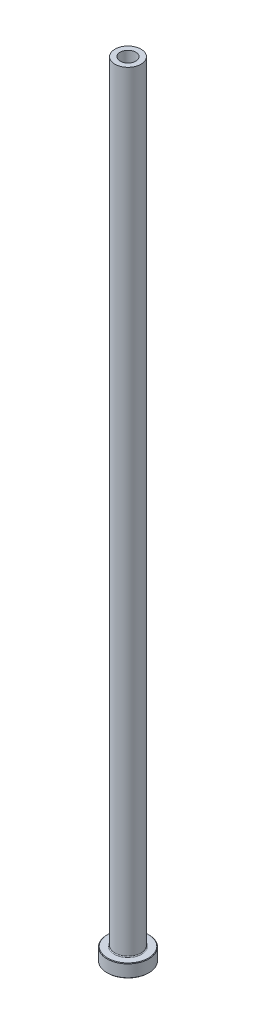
from build123d import *

# Parameters (mm, degrees)
FILLET1_R     = 0.3
CHAMFER1_SIZE = 0.2
CHAMFER3_SIZE = 0.5


with BuildPart() as part:
    # Sketch1 → Revolve1 (revolve)
    with BuildSketch(Plane.XY, mode=Mode.PRIVATE) as revolve1_sk:
        Polygon((-3, 300), (-5, 300), (-5, 5), (-8, 5), (-8, 0), (-3.25, 0), (-3.25, 243), (-3, 255), align=None)
    revolve(revolve1_sk.sketch.rotate(Axis((0, 92.187680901, 0), (0, -1, 0)), 270), axis=Axis((0, 92.187680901, 0), (0, -1, 0)))

    # Fillet1
    fillet1_edges = [part.edges().sort_by_distance(p)[0] for p in [
        (0, 5, -5),
    ]]
    fillet(fillet1_edges, radius=FILLET1_R)

    # Chamfer1
    chamfer1_edges = [part.edges().sort_by_distance(p)[0] for p in [
        (0, 0, -8),
        (0, 5, -8),
    ]]
    chamfer(chamfer1_edges, length=CHAMFER1_SIZE)

    # Chamfer3
    chamfer3_edges = [part.edges().sort_by_distance(p)[0] for p in [
        (0, 0, -3.25),
    ]]
    chamfer(chamfer3_edges, length=CHAMFER3_SIZE)


solid = part.part
